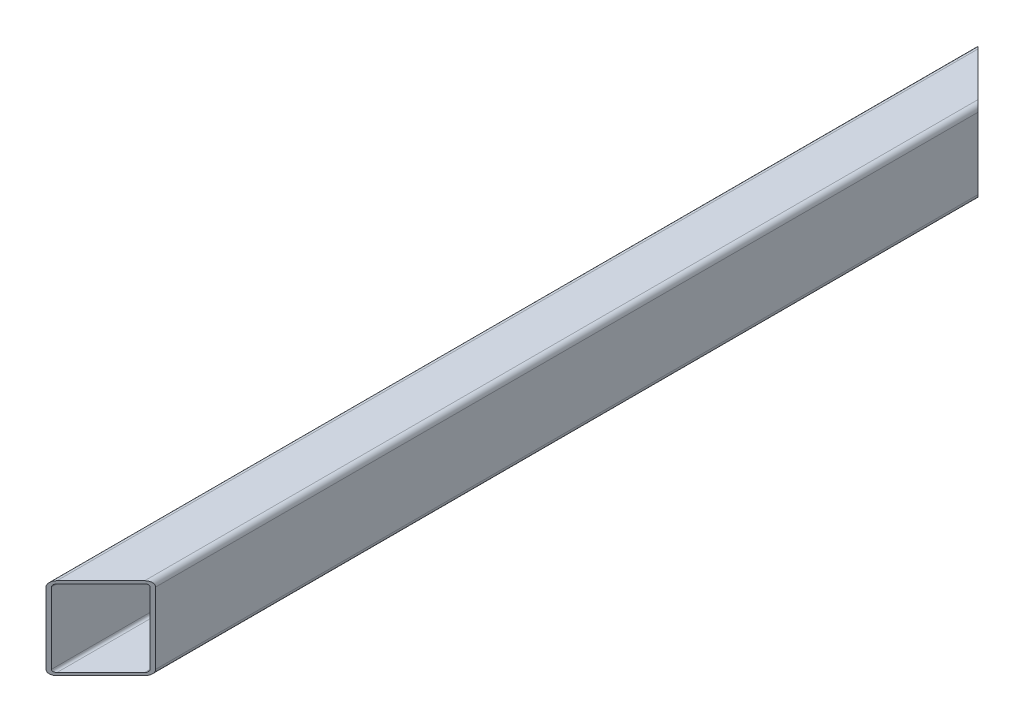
ISO-10303-21;
HEADER;
FILE_DESCRIPTION(('STEP AP214'),'2;1');
FILE_NAME('part.step','',(''),(''),'','','');
FILE_SCHEMA(('AUTOMOTIVE_DESIGN { 1 0 10303 214 1 1 1 1 }'));
ENDSEC;
DATA;
#1=APPLICATION_CONTEXT('core data for automotive mechanical design processes');
#2=APPLICATION_PROTOCOL_DEFINITION('international standard','automotive_design',2000,#1);
#3=PRODUCT_CONTEXT('',#1,'mechanical');
#4=PRODUCT('Part','Part','',(#3));
#5=PRODUCT_RELATED_PRODUCT_CATEGORY('part','',(#4));
#6=PRODUCT_DEFINITION_FORMATION('','',#4);
#7=PRODUCT_DEFINITION_CONTEXT('part definition',#1,'design');
#8=PRODUCT_DEFINITION('design','',#6,#7);
#9=PRODUCT_DEFINITION_SHAPE('','',#8);
#10=(LENGTH_UNIT() NAMED_UNIT(*) SI_UNIT(.MILLI.,.METRE.));
#11=(NAMED_UNIT(*) PLANE_ANGLE_UNIT() SI_UNIT($,.RADIAN.));
#12=(NAMED_UNIT(*) SI_UNIT($,.STERADIAN.) SOLID_ANGLE_UNIT());
#13=UNCERTAINTY_MEASURE_WITH_UNIT(LENGTH_MEASURE(1.E-05),#10,'distance_accuracy_value','');
#14=(GEOMETRIC_REPRESENTATION_CONTEXT(3) GLOBAL_UNCERTAINTY_ASSIGNED_CONTEXT((#13)) GLOBAL_UNIT_ASSIGNED_CONTEXT((#10,
#11,#12)) REPRESENTATION_CONTEXT('',''));
#15=CARTESIAN_POINT('',(0.,0.,0.));
#16=DIRECTION('',(0.,0.,1.));
#17=DIRECTION('',(1.,0.,0.));
#18=AXIS2_PLACEMENT_3D('',#15,#16,#17);
#19=CARTESIAN_POINT('',(-16.,26.0000000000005,340.));
#20=DIRECTION('',(0.,0.,-1.));
#21=DIRECTION('',(-1.,0.,0.));
#22=AXIS2_PLACEMENT_3D('',#19,#20,#21);
#23=CYLINDRICAL_SURFACE('',#22,4.);
#24=DIRECTION('',(0.,0.,-1.));
#25=VECTOR('',#24,1.);
#26=CARTESIAN_POINT('',(-20.,26.0000000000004,340.));
#27=LINE('',#26,#25);
#28=CARTESIAN_POINT('',(-20.,26.0000000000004,340.));
#29=VERTEX_POINT('',#28);
#30=CARTESIAN_POINT('',(-20.,25.9999999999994,-340.));
#31=VERTEX_POINT('',#30);
#32=EDGE_CURVE('E152',#29,#31,#27,.T.);
#33=ORIENTED_EDGE('',*,*,#32,.F.);
#34=CARTESIAN_POINT('',(-16.,26.0000000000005,336.));
#35=DIRECTION('',(-0.707106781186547,0.,-0.707106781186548));
#36=DIRECTION('',(0.707106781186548,0.,-0.707106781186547));
#37=AXIS2_PLACEMENT_3D('',#34,#35,#36);
#38=ELLIPSE('',#37,5.65685424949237,4.);
#39=CARTESIAN_POINT('',(-16.,30.0000000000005,336.));
#40=VERTEX_POINT('',#39);
#41=EDGE_CURVE('E139',#29,#40,#38,.T.);
#42=ORIENTED_EDGE('',*,*,#41,.T.);
#43=DIRECTION('',(0.,0.,-1.));
#44=VECTOR('',#43,1.);
#45=CARTESIAN_POINT('',(-16.,30.0000000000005,340.));
#46=LINE('',#45,#44);
#47=CARTESIAN_POINT('',(-16.,29.9999999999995,-336.));
#48=VERTEX_POINT('',#47);
#49=EDGE_CURVE('E149',#40,#48,#46,.T.);
#50=ORIENTED_EDGE('',*,*,#49,.T.);
#51=CARTESIAN_POINT('',(-16.,25.9999999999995,-336.));
#52=DIRECTION('',(-0.707106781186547,0.,0.707106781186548));
#53=DIRECTION('',(-0.707106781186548,0.,-0.707106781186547));
#54=AXIS2_PLACEMENT_3D('',#51,#52,#53);
#55=ELLIPSE('',#54,5.65685424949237,4.);
#56=EDGE_CURVE('E215',#48,#31,#55,.T.);
#57=ORIENTED_EDGE('',*,*,#56,.T.);
#58=EDGE_LOOP('',(#33,#42,#50,#57));
#59=FACE_BOUND('',#58,.T.);
#60=ADVANCED_FACE('F28',(#59),#23,.T.);
#61=CARTESIAN_POINT('',(-20.,-25.9999999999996,340.));
#62=DIRECTION('',(1.,0.,0.));
#63=DIRECTION('',(0.,0.,-1.));
#64=AXIS2_PLACEMENT_3D('',#61,#62,#63);
#65=PLANE('',#64);
#66=DIRECTION('',(0.,-1.,0.));
#67=VECTOR('',#66,1.);
#68=CARTESIAN_POINT('',(-20.,-26.0000000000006,-340.));
#69=LINE('',#68,#67);
#70=CARTESIAN_POINT('',(-20.,-26.0000000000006,-340.));
#71=VERTEX_POINT('',#70);
#72=EDGE_CURVE('E164',#31,#71,#69,.T.);
#73=ORIENTED_EDGE('',*,*,#72,.T.);
#74=DIRECTION('',(0.,0.,-1.));
#75=VECTOR('',#74,1.);
#76=CARTESIAN_POINT('',(-20.,-25.9999999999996,340.));
#77=LINE('',#76,#75);
#78=CARTESIAN_POINT('',(-20.,-25.9999999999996,340.));
#79=VERTEX_POINT('',#78);
#80=EDGE_CURVE('E175',#79,#71,#77,.T.);
#81=ORIENTED_EDGE('',*,*,#80,.F.);
#82=DIRECTION('',(0.,-1.,0.));
#83=VECTOR('',#82,1.);
#84=CARTESIAN_POINT('',(-20.,-25.9999999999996,340.));
#85=LINE('',#84,#83);
#86=EDGE_CURVE('E160',#29,#79,#85,.T.);
#87=ORIENTED_EDGE('',*,*,#86,.F.);
#88=ORIENTED_EDGE('',*,*,#32,.T.);
#89=EDGE_LOOP('',(#73,#81,#87,#88));
#90=FACE_BOUND('',#89,.T.);
#91=ADVANCED_FACE('F233',(#90),#65,.F.);
#92=CARTESIAN_POINT('',(-16.,-25.9999999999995,340.));
#93=DIRECTION('',(0.,0.,-1.));
#94=DIRECTION('',(-1.,0.,0.));
#95=AXIS2_PLACEMENT_3D('',#92,#93,#94);
#96=CYLINDRICAL_SURFACE('',#95,4.);
#97=DIRECTION('',(0.,0.,-1.));
#98=VECTOR('',#97,1.);
#99=CARTESIAN_POINT('',(-16.,-29.9999999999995,340.));
#100=LINE('',#99,#98);
#101=CARTESIAN_POINT('',(-16.,-29.9999999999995,336.));
#102=VERTEX_POINT('',#101);
#103=CARTESIAN_POINT('',(-16.,-30.0000000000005,-336.));
#104=VERTEX_POINT('',#103);
#105=EDGE_CURVE('E173',#102,#104,#100,.T.);
#106=ORIENTED_EDGE('',*,*,#105,.F.);
#107=CARTESIAN_POINT('',(-16.,-25.9999999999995,336.));
#108=DIRECTION('',(-0.707106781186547,0.,-0.707106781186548));
#109=DIRECTION('',(0.707106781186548,0.,-0.707106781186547));
#110=AXIS2_PLACEMENT_3D('',#107,#108,#109);
#111=ELLIPSE('',#110,5.65685424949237,4.);
#112=EDGE_CURVE('E154',#102,#79,#111,.T.);
#113=ORIENTED_EDGE('',*,*,#112,.T.);
#114=ORIENTED_EDGE('',*,*,#80,.T.);
#115=CARTESIAN_POINT('',(-16.,-26.0000000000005,-336.));
#116=DIRECTION('',(-0.707106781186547,0.,0.707106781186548));
#117=DIRECTION('',(-0.707106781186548,0.,-0.707106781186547));
#118=AXIS2_PLACEMENT_3D('',#115,#116,#117);
#119=ELLIPSE('',#118,5.65685424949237,4.);
#120=EDGE_CURVE('E212',#71,#104,#119,.T.);
#121=ORIENTED_EDGE('',*,*,#120,.T.);
#122=EDGE_LOOP('',(#106,#113,#114,#121));
#123=FACE_BOUND('',#122,.T.);
#124=ADVANCED_FACE('F237',(#123),#96,.T.);
#125=CARTESIAN_POINT('',(-16.,-29.9999999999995,340.));
#126=DIRECTION('',(0.,1.,0.));
#127=DIRECTION('',(-1.,0.,0.));
#128=AXIS2_PLACEMENT_3D('',#125,#126,#127);
#129=PLANE('',#128);
#130=DIRECTION('',(0.,0.,-1.));
#131=VECTOR('',#130,1.);
#132=CARTESIAN_POINT('',(16.,-29.9999999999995,340.000000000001));
#133=LINE('',#132,#131);
#134=CARTESIAN_POINT('',(16.,-29.9999999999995,304.000000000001));
#135=VERTEX_POINT('',#134);
#136=CARTESIAN_POINT('',(16.,-30.0000000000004,-304.));
#137=VERTEX_POINT('',#136);
#138=EDGE_CURVE('E171',#135,#137,#133,.T.);
#139=ORIENTED_EDGE('',*,*,#138,.F.);
#140=DIRECTION('',(-0.707106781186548,0.,0.707106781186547));
#141=VECTOR('',#140,1.);
#142=CARTESIAN_POINT('',(-20.,-29.9999999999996,340.));
#143=LINE('',#142,#141);
#144=EDGE_CURVE('E144',#135,#102,#143,.T.);
#145=ORIENTED_EDGE('',*,*,#144,.T.);
#146=ORIENTED_EDGE('',*,*,#105,.T.);
#147=DIRECTION('',(0.707106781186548,0.,0.707106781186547));
#148=VECTOR('',#147,1.);
#149=CARTESIAN_POINT('',(-20.,-30.0000000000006,-340.));
#150=LINE('',#149,#148);
#151=EDGE_CURVE('E246',#104,#137,#150,.T.);
#152=ORIENTED_EDGE('',*,*,#151,.T.);
#153=EDGE_LOOP('',(#139,#145,#146,#152));
#154=FACE_BOUND('',#153,.T.);
#155=ADVANCED_FACE('F315',(#154),#129,.F.);
#156=CARTESIAN_POINT('',(16.,-25.9999999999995,340.000000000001));
#157=DIRECTION('',(0.,0.,-1.));
#158=DIRECTION('',(-1.,0.,0.));
#159=AXIS2_PLACEMENT_3D('',#156,#157,#158);
#160=CYLINDRICAL_SURFACE('',#159,4.);
#161=DIRECTION('',(0.,0.,-1.));
#162=VECTOR('',#161,1.);
#163=CARTESIAN_POINT('',(20.,-25.9999999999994,340.000000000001));
#164=LINE('',#163,#162);
#165=CARTESIAN_POINT('',(20.,-25.9999999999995,300.000000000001));
#166=VERTEX_POINT('',#165);
#167=CARTESIAN_POINT('',(20.,-26.0000000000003,-300.));
#168=VERTEX_POINT('',#167);
#169=EDGE_CURVE('E169',#166,#168,#164,.T.);
#170=ORIENTED_EDGE('',*,*,#169,.F.);
#171=CARTESIAN_POINT('',(16.,-25.9999999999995,304.000000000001));
#172=DIRECTION('',(-0.707106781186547,0.,-0.707106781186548));
#173=DIRECTION('',(0.707106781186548,0.,-0.707106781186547));
#174=AXIS2_PLACEMENT_3D('',#171,#172,#173);
#175=ELLIPSE('',#174,5.65685424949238,4.);
#176=EDGE_CURVE('E239',#166,#135,#175,.T.);
#177=ORIENTED_EDGE('',*,*,#176,.T.);
#178=ORIENTED_EDGE('',*,*,#138,.T.);
#179=CARTESIAN_POINT('',(16.,-26.0000000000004,-304.));
#180=DIRECTION('',(-0.707106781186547,0.,0.707106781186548));
#181=DIRECTION('',(-0.707106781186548,0.,-0.707106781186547));
#182=AXIS2_PLACEMENT_3D('',#179,#180,#181);
#183=ELLIPSE('',#182,5.65685424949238,4.);
#184=EDGE_CURVE('E204',#137,#168,#183,.T.);
#185=ORIENTED_EDGE('',*,*,#184,.T.);
#186=EDGE_LOOP('',(#170,#177,#178,#185));
#187=FACE_BOUND('',#186,.T.);
#188=ADVANCED_FACE('F312',(#187),#160,.T.);
#189=CARTESIAN_POINT('',(20.,-25.9999999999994,340.000000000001));
#190=DIRECTION('',(-1.,0.,0.));
#191=DIRECTION('',(0.,0.,1.));
#192=AXIS2_PLACEMENT_3D('',#189,#190,#191);
#193=PLANE('',#192);
#194=DIRECTION('',(0.,0.,-1.));
#195=VECTOR('',#194,1.);
#196=CARTESIAN_POINT('',(20.,26.0000000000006,340.));
#197=LINE('',#196,#195);
#198=CARTESIAN_POINT('',(20.,26.0000000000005,300.));
#199=VERTEX_POINT('',#198);
#200=CARTESIAN_POINT('',(20.,25.9999999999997,-300.));
#201=VERTEX_POINT('',#200);
#202=EDGE_CURVE('E162',#199,#201,#197,.T.);
#203=ORIENTED_EDGE('',*,*,#202,.F.);
#204=DIRECTION('',(0.,1.,0.));
#205=VECTOR('',#204,1.);
#206=CARTESIAN_POINT('',(20.,-29.9999999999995,300.000000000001));
#207=LINE('',#206,#205);
#208=EDGE_CURVE('E288',#166,#199,#207,.T.);
#209=ORIENTED_EDGE('',*,*,#208,.F.);
#210=ORIENTED_EDGE('',*,*,#169,.T.);
#211=DIRECTION('',(0.,1.,0.));
#212=VECTOR('',#211,1.);
#213=CARTESIAN_POINT('',(20.,-30.0000000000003,-300.));
#214=LINE('',#213,#212);
#215=EDGE_CURVE('E249',#168,#201,#214,.T.);
#216=ORIENTED_EDGE('',*,*,#215,.T.);
#217=EDGE_LOOP('',(#203,#209,#210,#216));
#218=FACE_BOUND('',#217,.T.);
#219=ADVANCED_FACE('F306',(#218),#193,.F.);
#220=CARTESIAN_POINT('',(16.,26.0000000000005,340.));
#221=DIRECTION('',(0.,0.,-1.));
#222=DIRECTION('',(-1.,0.,0.));
#223=AXIS2_PLACEMENT_3D('',#220,#221,#222);
#224=CYLINDRICAL_SURFACE('',#223,4.);
#225=DIRECTION('',(0.,0.,-1.));
#226=VECTOR('',#225,1.);
#227=CARTESIAN_POINT('',(16.,30.0000000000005,340.));
#228=LINE('',#227,#226);
#229=CARTESIAN_POINT('',(16.,30.0000000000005,304.));
#230=VERTEX_POINT('',#229);
#231=CARTESIAN_POINT('',(15.9999999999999,29.9999999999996,-304.));
#232=VERTEX_POINT('',#231);
#233=EDGE_CURVE('E159',#230,#232,#228,.T.);
#234=ORIENTED_EDGE('',*,*,#233,.F.);
#235=CARTESIAN_POINT('',(16.,26.0000000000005,304.));
#236=DIRECTION('',(-0.707106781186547,0.,-0.707106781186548));
#237=DIRECTION('',(0.707106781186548,0.,-0.707106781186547));
#238=AXIS2_PLACEMENT_3D('',#235,#236,#237);
#239=ELLIPSE('',#238,5.65685424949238,4.);
#240=EDGE_CURVE('E42',#230,#199,#239,.T.);
#241=ORIENTED_EDGE('',*,*,#240,.T.);
#242=ORIENTED_EDGE('',*,*,#202,.T.);
#243=CARTESIAN_POINT('',(16.,25.9999999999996,-304.));
#244=DIRECTION('',(-0.707106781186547,0.,0.707106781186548));
#245=DIRECTION('',(-0.707106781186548,0.,-0.707106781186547));
#246=AXIS2_PLACEMENT_3D('',#243,#244,#245);
#247=ELLIPSE('',#246,5.65685424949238,4.);
#248=EDGE_CURVE('E200',#201,#232,#247,.T.);
#249=ORIENTED_EDGE('',*,*,#248,.T.);
#250=EDGE_LOOP('',(#234,#241,#242,#249));
#251=FACE_BOUND('',#250,.T.);
#252=ADVANCED_FACE('F302',(#251),#224,.T.);
#253=CARTESIAN_POINT('',(-16.,30.0000000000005,340.));
#254=DIRECTION('',(0.,-1.,0.));
#255=DIRECTION('',(1.,0.,0.));
#256=AXIS2_PLACEMENT_3D('',#253,#254,#255);
#257=PLANE('',#256);
#258=ORIENTED_EDGE('',*,*,#49,.F.);
#259=DIRECTION('',(-0.707106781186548,0.,0.707106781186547));
#260=VECTOR('',#259,1.);
#261=CARTESIAN_POINT('',(-20.,30.0000000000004,340.));
#262=LINE('',#261,#260);
#263=EDGE_CURVE('E136',#230,#40,#262,.T.);
#264=ORIENTED_EDGE('',*,*,#263,.F.);
#265=ORIENTED_EDGE('',*,*,#233,.T.);
#266=DIRECTION('',(0.707106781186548,0.,0.707106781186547));
#267=VECTOR('',#266,1.);
#268=CARTESIAN_POINT('',(-20.,29.9999999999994,-340.));
#269=LINE('',#268,#267);
#270=EDGE_CURVE('E153',#48,#232,#269,.T.);
#271=ORIENTED_EDGE('',*,*,#270,.F.);
#272=EDGE_LOOP('',(#258,#264,#265,#271));
#273=FACE_BOUND('',#272,.T.);
#274=ADVANCED_FACE('F157',(#273),#257,.F.);
#275=CARTESIAN_POINT('',(-16.,26.0000000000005,340.));
#276=DIRECTION('',(0.,0.,-1.));
#277=DIRECTION('',(-1.,0.,0.));
#278=AXIS2_PLACEMENT_3D('',#275,#276,#277);
#279=CYLINDRICAL_SURFACE('',#278,2.);
#280=CARTESIAN_POINT('',(-16.,26.0000000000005,336.));
#281=DIRECTION('',(-0.707106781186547,0.,-0.707106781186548));
#282=DIRECTION('',(0.707106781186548,0.,-0.707106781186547));
#283=AXIS2_PLACEMENT_3D('',#280,#281,#282);
#284=ELLIPSE('',#283,2.82842712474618,2.);
#285=CARTESIAN_POINT('',(-18.,26.0000000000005,338.));
#286=VERTEX_POINT('',#285);
#287=CARTESIAN_POINT('',(-16.,28.0000000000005,336.));
#288=VERTEX_POINT('',#287);
#289=EDGE_CURVE('E49',#286,#288,#284,.T.);
#290=ORIENTED_EDGE('',*,*,#289,.F.);
#291=DIRECTION('',(0.,0.,-1.));
#292=VECTOR('',#291,1.);
#293=CARTESIAN_POINT('',(-18.,26.0000000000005,340.));
#294=LINE('',#293,#292);
#295=CARTESIAN_POINT('',(-18.,25.9999999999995,-338.));
#296=VERTEX_POINT('',#295);
#297=EDGE_CURVE('E199',#286,#296,#294,.T.);
#298=ORIENTED_EDGE('',*,*,#297,.T.);
#299=CARTESIAN_POINT('',(-16.,25.9999999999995,-336.));
#300=DIRECTION('',(-0.707106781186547,0.,0.707106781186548));
#301=DIRECTION('',(-0.707106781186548,0.,-0.707106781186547));
#302=AXIS2_PLACEMENT_3D('',#299,#300,#301);
#303=ELLIPSE('',#302,2.82842712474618,2.);
#304=CARTESIAN_POINT('',(-16.,27.9999999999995,-336.));
#305=VERTEX_POINT('',#304);
#306=EDGE_CURVE('E187',#305,#296,#303,.T.);
#307=ORIENTED_EDGE('',*,*,#306,.F.);
#308=DIRECTION('',(0.,0.,-1.));
#309=VECTOR('',#308,1.);
#310=CARTESIAN_POINT('',(-16.,28.0000000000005,340.));
#311=LINE('',#310,#309);
#312=EDGE_CURVE('E197',#288,#305,#311,.T.);
#313=ORIENTED_EDGE('',*,*,#312,.F.);
#314=EDGE_LOOP('',(#290,#298,#307,#313));
#315=FACE_BOUND('',#314,.T.);
#316=ADVANCED_FACE('F196',(#315),#279,.F.);
#317=CARTESIAN_POINT('',(-18.,-25.9999999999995,340.));
#318=DIRECTION('',(1.,0.,0.));
#319=DIRECTION('',(0.,0.,-1.));
#320=AXIS2_PLACEMENT_3D('',#317,#318,#319);
#321=PLANE('',#320);
#322=DIRECTION('',(0.,1.,0.));
#323=VECTOR('',#322,1.);
#324=CARTESIAN_POINT('',(-18.,-25.9999999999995,338.));
#325=LINE('',#324,#323);
#326=CARTESIAN_POINT('',(-18.,-25.9999999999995,338.));
#327=VERTEX_POINT('',#326);
#328=EDGE_CURVE('E298',#327,#286,#325,.T.);
#329=ORIENTED_EDGE('',*,*,#328,.F.);
#330=DIRECTION('',(0.,0.,-1.));
#331=VECTOR('',#330,1.);
#332=CARTESIAN_POINT('',(-18.,-25.9999999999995,340.));
#333=LINE('',#332,#331);
#334=CARTESIAN_POINT('',(-18.,-26.0000000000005,-338.));
#335=VERTEX_POINT('',#334);
#336=EDGE_CURVE('E228',#327,#335,#333,.T.);
#337=ORIENTED_EDGE('',*,*,#336,.T.);
#338=DIRECTION('',(0.,-1.,0.));
#339=VECTOR('',#338,1.);
#340=CARTESIAN_POINT('',(-18.,-26.0000000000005,-338.));
#341=LINE('',#340,#339);
#342=EDGE_CURVE('E201',#296,#335,#341,.T.);
#343=ORIENTED_EDGE('',*,*,#342,.F.);
#344=ORIENTED_EDGE('',*,*,#297,.F.);
#345=EDGE_LOOP('',(#329,#337,#343,#344));
#346=FACE_BOUND('',#345,.T.);
#347=ADVANCED_FACE('F365',(#346),#321,.T.);
#348=CARTESIAN_POINT('',(-16.,-25.9999999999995,340.));
#349=DIRECTION('',(0.,0.,-1.));
#350=DIRECTION('',(-1.,0.,0.));
#351=AXIS2_PLACEMENT_3D('',#348,#349,#350);
#352=CYLINDRICAL_SURFACE('',#351,2.);
#353=CARTESIAN_POINT('',(-16.,-25.9999999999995,336.));
#354=DIRECTION('',(-0.707106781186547,0.,-0.707106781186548));
#355=DIRECTION('',(0.707106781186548,0.,-0.707106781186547));
#356=AXIS2_PLACEMENT_3D('',#353,#354,#355);
#357=ELLIPSE('',#356,2.82842712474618,2.);
#358=CARTESIAN_POINT('',(-16.,-27.9999999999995,336.));
#359=VERTEX_POINT('',#358);
#360=EDGE_CURVE('E296',#359,#327,#357,.T.);
#361=ORIENTED_EDGE('',*,*,#360,.F.);
#362=DIRECTION('',(0.,0.,-1.));
#363=VECTOR('',#362,1.);
#364=CARTESIAN_POINT('',(-16.,-27.9999999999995,340.));
#365=LINE('',#364,#363);
#366=CARTESIAN_POINT('',(-16.,-28.0000000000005,-336.));
#367=VERTEX_POINT('',#366);
#368=EDGE_CURVE('E226',#359,#367,#365,.T.);
#369=ORIENTED_EDGE('',*,*,#368,.T.);
#370=CARTESIAN_POINT('',(-16.,-26.0000000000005,-336.));
#371=DIRECTION('',(-0.707106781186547,0.,0.707106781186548));
#372=DIRECTION('',(-0.707106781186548,0.,-0.707106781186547));
#373=AXIS2_PLACEMENT_3D('',#370,#371,#372);
#374=ELLIPSE('',#373,2.82842712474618,2.);
#375=EDGE_CURVE('E206',#335,#367,#374,.T.);
#376=ORIENTED_EDGE('',*,*,#375,.F.);
#377=ORIENTED_EDGE('',*,*,#336,.F.);
#378=EDGE_LOOP('',(#361,#369,#376,#377));
#379=FACE_BOUND('',#378,.T.);
#380=ADVANCED_FACE('F372',(#379),#352,.F.);
#381=CARTESIAN_POINT('',(-16.,-27.9999999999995,340.));
#382=DIRECTION('',(0.,1.,0.));
#383=DIRECTION('',(-1.,0.,0.));
#384=AXIS2_PLACEMENT_3D('',#381,#382,#383);
#385=PLANE('',#384);
#386=DIRECTION('',(-0.707106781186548,0.,0.707106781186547));
#387=VECTOR('',#386,1.);
#388=CARTESIAN_POINT('',(-18.,-27.9999999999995,338.));
#389=LINE('',#388,#387);
#390=CARTESIAN_POINT('',(16.,-27.9999999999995,304.000000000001));
#391=VERTEX_POINT('',#390);
#392=EDGE_CURVE('E271',#391,#359,#389,.T.);
#393=ORIENTED_EDGE('',*,*,#392,.F.);
#394=DIRECTION('',(0.,0.,-1.));
#395=VECTOR('',#394,1.);
#396=CARTESIAN_POINT('',(16.,-27.9999999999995,340.000000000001));
#397=LINE('',#396,#395);
#398=CARTESIAN_POINT('',(16.,-28.0000000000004,-304.));
#399=VERTEX_POINT('',#398);
#400=EDGE_CURVE('E224',#391,#399,#397,.T.);
#401=ORIENTED_EDGE('',*,*,#400,.T.);
#402=DIRECTION('',(0.707106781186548,0.,0.707106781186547));
#403=VECTOR('',#402,1.);
#404=CARTESIAN_POINT('',(322.,-27.9999999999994,1.99999999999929));
#405=LINE('',#404,#403);
#406=EDGE_CURVE('E258',#367,#399,#405,.T.);
#407=ORIENTED_EDGE('',*,*,#406,.F.);
#408=ORIENTED_EDGE('',*,*,#368,.F.);
#409=EDGE_LOOP('',(#393,#401,#407,#408));
#410=FACE_BOUND('',#409,.T.);
#411=ADVANCED_FACE('F269',(#410),#385,.T.);
#412=CARTESIAN_POINT('',(16.,-25.9999999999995,340.000000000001));
#413=DIRECTION('',(0.,0.,-1.));
#414=DIRECTION('',(-1.,0.,0.));
#415=AXIS2_PLACEMENT_3D('',#412,#413,#414);
#416=CYLINDRICAL_SURFACE('',#415,2.);
#417=CARTESIAN_POINT('',(16.,-25.9999999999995,304.000000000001));
#418=DIRECTION('',(-0.707106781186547,0.,-0.707106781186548));
#419=DIRECTION('',(0.707106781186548,0.,-0.707106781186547));
#420=AXIS2_PLACEMENT_3D('',#417,#418,#419);
#421=ELLIPSE('',#420,2.82842712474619,2.);
#422=CARTESIAN_POINT('',(18.,-25.9999999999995,302.000000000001));
#423=VERTEX_POINT('',#422);
#424=EDGE_CURVE('E275',#423,#391,#421,.T.);
#425=ORIENTED_EDGE('',*,*,#424,.F.);
#426=DIRECTION('',(0.,0.,-1.));
#427=VECTOR('',#426,1.);
#428=CARTESIAN_POINT('',(18.,-25.9999999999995,340.000000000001));
#429=LINE('',#428,#427);
#430=CARTESIAN_POINT('',(18.,-26.0000000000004,-302.));
#431=VERTEX_POINT('',#430);
#432=EDGE_CURVE('E222',#423,#431,#429,.T.);
#433=ORIENTED_EDGE('',*,*,#432,.T.);
#434=CARTESIAN_POINT('',(16.,-26.0000000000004,-304.));
#435=DIRECTION('',(-0.707106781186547,0.,0.707106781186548));
#436=DIRECTION('',(-0.707106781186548,0.,-0.707106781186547));
#437=AXIS2_PLACEMENT_3D('',#434,#435,#436);
#438=ELLIPSE('',#437,2.82842712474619,2.);
#439=EDGE_CURVE('E255',#399,#431,#438,.T.);
#440=ORIENTED_EDGE('',*,*,#439,.F.);
#441=ORIENTED_EDGE('',*,*,#400,.F.);
#442=EDGE_LOOP('',(#425,#433,#440,#441));
#443=FACE_BOUND('',#442,.T.);
#444=ADVANCED_FACE('F274',(#443),#416,.F.);
#445=CARTESIAN_POINT('',(18.,-25.9999999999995,340.000000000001));
#446=DIRECTION('',(-1.,0.,0.));
#447=DIRECTION('',(0.,0.,1.));
#448=AXIS2_PLACEMENT_3D('',#445,#446,#447);
#449=PLANE('',#448);
#450=DIRECTION('',(0.,-1.,0.));
#451=VECTOR('',#450,1.);
#452=CARTESIAN_POINT('',(18.,-25.9999999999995,302.000000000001));
#453=LINE('',#452,#451);
#454=CARTESIAN_POINT('',(18.,26.0000000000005,302.));
#455=VERTEX_POINT('',#454);
#456=EDGE_CURVE('E282',#455,#423,#453,.T.);
#457=ORIENTED_EDGE('',*,*,#456,.F.);
#458=DIRECTION('',(0.,0.,-1.));
#459=VECTOR('',#458,1.);
#460=CARTESIAN_POINT('',(18.,26.0000000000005,340.));
#461=LINE('',#460,#459);
#462=CARTESIAN_POINT('',(18.,25.9999999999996,-302.));
#463=VERTEX_POINT('',#462);
#464=EDGE_CURVE('E220',#455,#463,#461,.T.);
#465=ORIENTED_EDGE('',*,*,#464,.T.);
#466=DIRECTION('',(0.,1.,0.));
#467=VECTOR('',#466,1.);
#468=CARTESIAN_POINT('',(18.,-26.0000000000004,-302.));
#469=LINE('',#468,#467);
#470=EDGE_CURVE('E253',#431,#463,#469,.T.);
#471=ORIENTED_EDGE('',*,*,#470,.F.);
#472=ORIENTED_EDGE('',*,*,#432,.F.);
#473=EDGE_LOOP('',(#457,#465,#471,#472));
#474=FACE_BOUND('',#473,.T.);
#475=ADVANCED_FACE('F280',(#474),#449,.T.);
#476=CARTESIAN_POINT('',(16.,26.0000000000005,340.));
#477=DIRECTION('',(0.,0.,-1.));
#478=DIRECTION('',(-1.,0.,0.));
#479=AXIS2_PLACEMENT_3D('',#476,#477,#478);
#480=CYLINDRICAL_SURFACE('',#479,2.);
#481=CARTESIAN_POINT('',(16.,26.0000000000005,304.));
#482=DIRECTION('',(-0.707106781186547,0.,-0.707106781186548));
#483=DIRECTION('',(0.707106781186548,0.,-0.707106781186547));
#484=AXIS2_PLACEMENT_3D('',#481,#482,#483);
#485=ELLIPSE('',#484,2.82842712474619,2.);
#486=CARTESIAN_POINT('',(16.,28.0000000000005,304.));
#487=VERTEX_POINT('',#486);
#488=EDGE_CURVE('E286',#487,#455,#485,.T.);
#489=ORIENTED_EDGE('',*,*,#488,.F.);
#490=DIRECTION('',(0.,0.,-1.));
#491=VECTOR('',#490,1.);
#492=CARTESIAN_POINT('',(16.,28.0000000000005,340.));
#493=LINE('',#492,#491);
#494=CARTESIAN_POINT('',(16.,27.9999999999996,-304.));
#495=VERTEX_POINT('',#494);
#496=EDGE_CURVE('E218',#487,#495,#493,.T.);
#497=ORIENTED_EDGE('',*,*,#496,.T.);
#498=CARTESIAN_POINT('',(16.,25.9999999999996,-304.));
#499=DIRECTION('',(-0.707106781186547,0.,0.707106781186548));
#500=DIRECTION('',(-0.707106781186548,0.,-0.707106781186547));
#501=AXIS2_PLACEMENT_3D('',#498,#499,#500);
#502=ELLIPSE('',#501,2.82842712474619,2.);
#503=EDGE_CURVE('E191',#463,#495,#502,.T.);
#504=ORIENTED_EDGE('',*,*,#503,.F.);
#505=ORIENTED_EDGE('',*,*,#464,.F.);
#506=EDGE_LOOP('',(#489,#497,#504,#505));
#507=FACE_BOUND('',#506,.T.);
#508=ADVANCED_FACE('F285',(#507),#480,.F.);
#509=CARTESIAN_POINT('',(-16.,28.0000000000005,340.));
#510=DIRECTION('',(0.,-1.,0.));
#511=DIRECTION('',(1.,0.,0.));
#512=AXIS2_PLACEMENT_3D('',#509,#510,#511);
#513=PLANE('',#512);
#514=DIRECTION('',(0.707106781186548,0.,-0.707106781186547));
#515=VECTOR('',#514,1.);
#516=CARTESIAN_POINT('',(-18.,28.0000000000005,338.));
#517=LINE('',#516,#515);
#518=EDGE_CURVE('E11',#288,#487,#517,.T.);
#519=ORIENTED_EDGE('',*,*,#518,.F.);
#520=ORIENTED_EDGE('',*,*,#312,.T.);
#521=DIRECTION('',(-0.707106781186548,0.,-0.707106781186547));
#522=VECTOR('',#521,1.);
#523=CARTESIAN_POINT('',(322.,28.0000000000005,1.99999999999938));
#524=LINE('',#523,#522);
#525=EDGE_CURVE('E35',#495,#305,#524,.T.);
#526=ORIENTED_EDGE('',*,*,#525,.F.);
#527=ORIENTED_EDGE('',*,*,#496,.F.);
#528=EDGE_LOOP('',(#519,#520,#526,#527));
#529=FACE_BOUND('',#528,.T.);
#530=ADVANCED_FACE('F287',(#529),#513,.T.);
#531=CARTESIAN_POINT('',(-20.,-30.0000000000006,-340.));
#532=DIRECTION('',(-0.707106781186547,0.,0.707106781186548));
#533=DIRECTION('',(0.707106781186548,0.,0.707106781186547));
#534=AXIS2_PLACEMENT_3D('',#531,#532,#533);
#535=PLANE('',#534);
#536=ORIENTED_EDGE('',*,*,#306,.T.);
#537=ORIENTED_EDGE('',*,*,#342,.T.);
#538=ORIENTED_EDGE('',*,*,#375,.T.);
#539=ORIENTED_EDGE('',*,*,#406,.T.);
#540=ORIENTED_EDGE('',*,*,#439,.T.);
#541=ORIENTED_EDGE('',*,*,#470,.T.);
#542=ORIENTED_EDGE('',*,*,#503,.T.);
#543=ORIENTED_EDGE('',*,*,#525,.T.);
#544=EDGE_LOOP('',(#536,#537,#538,#539,#540,#541,#542,#543));
#545=FACE_BOUND('',#544,.T.);
#546=ORIENTED_EDGE('',*,*,#270,.T.);
#547=ORIENTED_EDGE('',*,*,#248,.F.);
#548=ORIENTED_EDGE('',*,*,#215,.F.);
#549=ORIENTED_EDGE('',*,*,#184,.F.);
#550=ORIENTED_EDGE('',*,*,#151,.F.);
#551=ORIENTED_EDGE('',*,*,#120,.F.);
#552=ORIENTED_EDGE('',*,*,#72,.F.);
#553=ORIENTED_EDGE('',*,*,#56,.F.);
#554=EDGE_LOOP('',(#546,#547,#548,#549,#550,#551,#552,#553));
#555=FACE_BOUND('',#554,.T.);
#556=ADVANCED_FACE('F184',(#545,#555),#535,.F.);
#557=CARTESIAN_POINT('',(-20.,-29.9999999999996,340.));
#558=DIRECTION('',(-0.707106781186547,0.,-0.707106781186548));
#559=DIRECTION('',(-0.707106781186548,0.,0.707106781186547));
#560=AXIS2_PLACEMENT_3D('',#557,#558,#559);
#561=PLANE('',#560);
#562=ORIENTED_EDGE('',*,*,#289,.T.);
#563=ORIENTED_EDGE('',*,*,#518,.T.);
#564=ORIENTED_EDGE('',*,*,#488,.T.);
#565=ORIENTED_EDGE('',*,*,#456,.T.);
#566=ORIENTED_EDGE('',*,*,#424,.T.);
#567=ORIENTED_EDGE('',*,*,#392,.T.);
#568=ORIENTED_EDGE('',*,*,#360,.T.);
#569=ORIENTED_EDGE('',*,*,#328,.T.);
#570=EDGE_LOOP('',(#562,#563,#564,#565,#566,#567,#568,#569));
#571=FACE_BOUND('',#570,.T.);
#572=ORIENTED_EDGE('',*,*,#86,.T.);
#573=ORIENTED_EDGE('',*,*,#112,.F.);
#574=ORIENTED_EDGE('',*,*,#144,.F.);
#575=ORIENTED_EDGE('',*,*,#176,.F.);
#576=ORIENTED_EDGE('',*,*,#208,.T.);
#577=ORIENTED_EDGE('',*,*,#240,.F.);
#578=ORIENTED_EDGE('',*,*,#263,.T.);
#579=ORIENTED_EDGE('',*,*,#41,.F.);
#580=EDGE_LOOP('',(#572,#573,#574,#575,#576,#577,#578,#579));
#581=FACE_BOUND('',#580,.T.);
#582=ADVANCED_FACE('F138',(#571,#581),#561,.F.);
#583=CLOSED_SHELL('',(#60,#91,#124,#155,#188,#219,#252,#274,#316,#347,#380,#411,#444,#475,#508,
#530,#556,#582));
#584=MANIFOLD_SOLID_BREP('B2',#583);
#585=ADVANCED_BREP_SHAPE_REPRESENTATION('',(#18,#584),#14);
#586=SHAPE_DEFINITION_REPRESENTATION(#9,#585);
ENDSEC;
END-ISO-10303-21;
